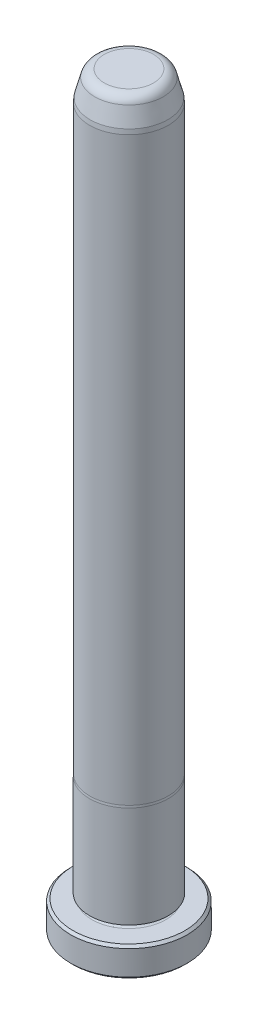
from build123d import *

# Parameters (mm, degrees)
FILLET6_R     = 1.5875
CHAMFER1_SIZE = 0.381


with BuildPart() as part:
    # Sketch1 → Revolve1 (revolve)
    with BuildSketch(Plane(origin=(0, 0, 0), x_dir=(0, 0, -1), z_dir=(1, 0, 0)), mode=Mode.PRIVATE) as revolve1_sk:
        with BuildLine():
            Line((0, 0), (9.398, 0))
            Line((9.398, 0), (9.398, 4.7498))
            Line((9.398, 4.7498), (5.9563, 4.7498))
            ThreePointArc((5.9563, 4.7498), (5.5753, 5.1308), (5.9563, 5.5118))
            Line((5.9563, 5.5118), (6.3627, 5.5118))
            Line((6.3627, 5.5118), (6.3627, 21.861763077))
            Line((6.3627, 21.861763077), (6.3373, 22.225))
            Line((6.3373, 22.225), (6.3373, 115.9002))
            Line((6.3373, 115.9002), (6.270633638, 116.6622))
            Line((6.270633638, 116.6622), (5.202105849, 120.65))
            Line((5.202105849, 120.65), (0, 120.65))
            Line((0, 120.65), (0, 0))
        make_face()
    revolve(revolve1_sk.sketch.rotate(Axis((0, 0, 0), (0, -1, 0)), 180), axis=Axis((0, 0, 0), (0, -1, 0)))

    # Fillet6
    fillet6_edges = [part.edges().sort_by_distance(p)[0] for p in [
        (0, 120.65, -5.202105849),
    ]]
    fillet(fillet6_edges, radius=FILLET6_R)

    # Chamfer1
    chamfer1_edges = [part.edges().sort_by_distance(p)[0] for p in [
        (0, 4.7498, -9.398),
        (0, 0, -9.398),
    ]]
    chamfer(chamfer1_edges, length=CHAMFER1_SIZE)


solid = part.part
